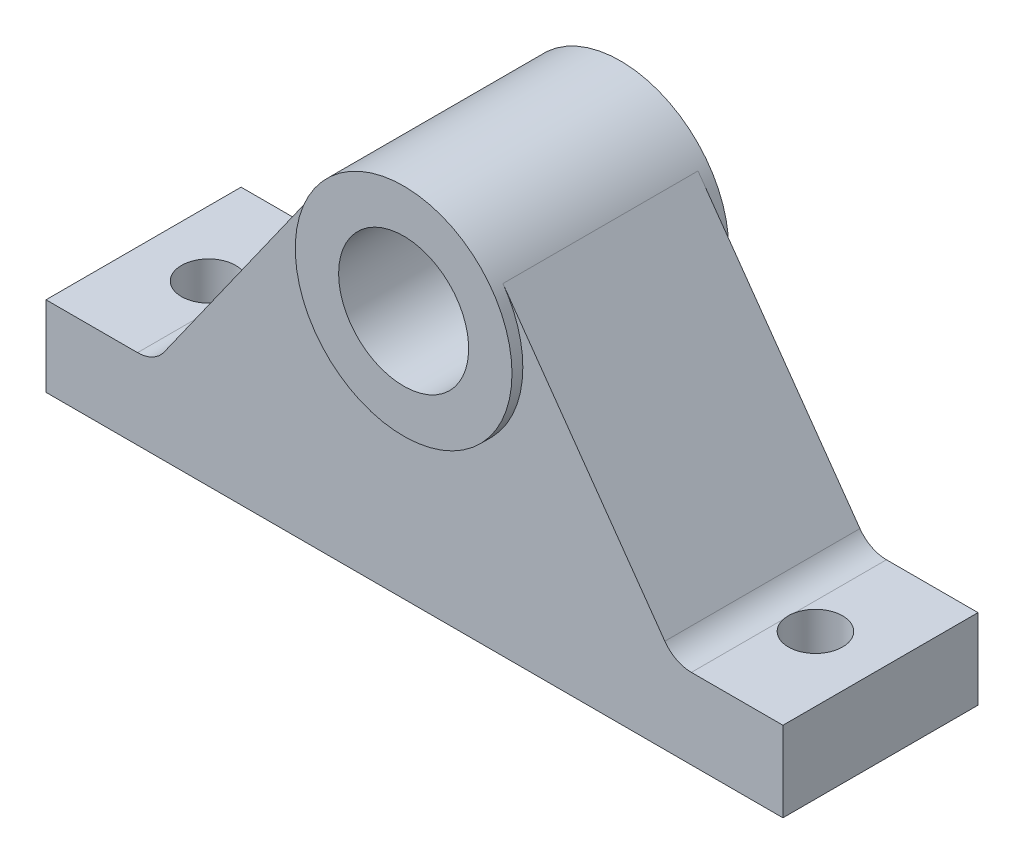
ISO-10303-21;
HEADER;
FILE_DESCRIPTION(('STEP AP214'),'2;1');
FILE_NAME('part.step','',(''),(''),'','','');
FILE_SCHEMA(('AUTOMOTIVE_DESIGN { 1 0 10303 214 1 1 1 1 }'));
ENDSEC;
DATA;
#1=APPLICATION_CONTEXT('core data for automotive mechanical design processes');
#2=APPLICATION_PROTOCOL_DEFINITION('international standard','automotive_design',2000,#1);
#3=PRODUCT_CONTEXT('',#1,'mechanical');
#4=PRODUCT('Part','Part','',(#3));
#5=PRODUCT_RELATED_PRODUCT_CATEGORY('part','',(#4));
#6=PRODUCT_DEFINITION_FORMATION('','',#4);
#7=PRODUCT_DEFINITION_CONTEXT('part definition',#1,'design');
#8=PRODUCT_DEFINITION('design','',#6,#7);
#9=PRODUCT_DEFINITION_SHAPE('','',#8);
#10=(LENGTH_UNIT() NAMED_UNIT(*) SI_UNIT(.MILLI.,.METRE.));
#11=(NAMED_UNIT(*) PLANE_ANGLE_UNIT() SI_UNIT($,.RADIAN.));
#12=(NAMED_UNIT(*) SI_UNIT($,.STERADIAN.) SOLID_ANGLE_UNIT());
#13=UNCERTAINTY_MEASURE_WITH_UNIT(LENGTH_MEASURE(1.E-05),#10,'distance_accuracy_value','');
#14=(GEOMETRIC_REPRESENTATION_CONTEXT(3) GLOBAL_UNCERTAINTY_ASSIGNED_CONTEXT((#13)) GLOBAL_UNIT_ASSIGNED_CONTEXT((#10,
#11,#12)) REPRESENTATION_CONTEXT('',''));
#15=CARTESIAN_POINT('',(0.,0.,0.));
#16=DIRECTION('',(0.,0.,1.));
#17=DIRECTION('',(1.,0.,0.));
#18=AXIS2_PLACEMENT_3D('',#15,#16,#17);
#19=CARTESIAN_POINT('',(0.,83.,45.));
#20=DIRECTION('',(0.,0.,1.));
#21=DIRECTION('',(1.,0.,0.));
#22=AXIS2_PLACEMENT_3D('',#19,#20,#21);
#23=PLANE('',#22);
#24=CARTESIAN_POINT('',(0.,83.,45.));
#25=DIRECTION('',(0.,0.,1.));
#26=DIRECTION('',(1.,0.,0.));
#27=AXIS2_PLACEMENT_3D('',#24,#25,#26);
#28=CIRCLE('',#27,50.);
#29=CARTESIAN_POINT('',(-40.8122898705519,111.885238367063,45.));
#30=VERTEX_POINT('',#29);
#31=CARTESIAN_POINT('',(40.8122898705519,111.885238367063,45.));
#32=VERTEX_POINT('',#31);
#33=EDGE_CURVE('E279',#30,#32,#28,.T.);
#34=ORIENTED_EDGE('',*,*,#33,.F.);
#35=DIRECTION('',(-0.57770476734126,-0.816245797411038,0.));
#36=VECTOR('',#35,1.);
#37=CARTESIAN_POINT('',(-40.8122898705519,111.885238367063,45.));
#38=LINE('',#37,#36);
#39=CARTESIAN_POINT('',(-115.516755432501,6.3344284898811,45.));
#40=VERTEX_POINT('',#39);
#41=EDGE_CURVE('E272',#30,#40,#38,.T.);
#42=ORIENTED_EDGE('',*,*,#41,.T.);
#43=CARTESIAN_POINT('',(-127.760442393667,15.,45.));
#44=DIRECTION('',(0.,0.,1.));
#45=DIRECTION('',(1.,0.,0.));
#46=AXIS2_PLACEMENT_3D('',#43,#44,#45);
#47=CIRCLE('',#46,15.);
#48=CARTESIAN_POINT('',(-127.760442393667,0.,45.));
#49=VERTEX_POINT('',#48);
#50=EDGE_CURVE('E166',#40,#49,#47,.F.);
#51=ORIENTED_EDGE('',*,*,#50,.T.);
#52=DIRECTION('',(-1.,0.,0.));
#53=VECTOR('',#52,1.);
#54=CARTESIAN_POINT('',(-170.,0.,45.));
#55=LINE('',#54,#53);
#56=CARTESIAN_POINT('',(-170.,0.,45.));
#57=VERTEX_POINT('',#56);
#58=EDGE_CURVE('E269',#49,#57,#55,.T.);
#59=ORIENTED_EDGE('',*,*,#58,.T.);
#60=DIRECTION('',(0.,-1.,0.));
#61=VECTOR('',#60,1.);
#62=CARTESIAN_POINT('',(-170.,0.,45.));
#63=LINE('',#62,#61);
#64=CARTESIAN_POINT('',(-170.,-37.,45.));
#65=VERTEX_POINT('',#64);
#66=EDGE_CURVE('E259',#57,#65,#63,.T.);
#67=ORIENTED_EDGE('',*,*,#66,.T.);
#68=DIRECTION('',(1.,0.,0.));
#69=VECTOR('',#68,1.);
#70=CARTESIAN_POINT('',(-170.,-37.,45.));
#71=LINE('',#70,#69);
#72=CARTESIAN_POINT('',(170.,-37.,45.));
#73=VERTEX_POINT('',#72);
#74=EDGE_CURVE('E263',#65,#73,#71,.T.);
#75=ORIENTED_EDGE('',*,*,#74,.T.);
#76=DIRECTION('',(0.,1.,0.));
#77=VECTOR('',#76,1.);
#78=CARTESIAN_POINT('',(170.,0.,45.));
#79=LINE('',#78,#77);
#80=CARTESIAN_POINT('',(170.,0.,45.));
#81=VERTEX_POINT('',#80);
#82=EDGE_CURVE('E246',#73,#81,#79,.T.);
#83=ORIENTED_EDGE('',*,*,#82,.T.);
#84=DIRECTION('',(-1.,0.,0.));
#85=VECTOR('',#84,1.);
#86=CARTESIAN_POINT('',(120.,0.,45.));
#87=LINE('',#86,#85);
#88=CARTESIAN_POINT('',(127.760442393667,0.,45.));
#89=VERTEX_POINT('',#88);
#90=EDGE_CURVE('E266',#81,#89,#87,.T.);
#91=ORIENTED_EDGE('',*,*,#90,.T.);
#92=CARTESIAN_POINT('',(127.760442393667,15.,45.));
#93=DIRECTION('',(0.,0.,1.));
#94=DIRECTION('',(1.,0.,0.));
#95=AXIS2_PLACEMENT_3D('',#92,#93,#94);
#96=CIRCLE('',#95,15.);
#97=CARTESIAN_POINT('',(115.516755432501,6.3344284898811,45.));
#98=VERTEX_POINT('',#97);
#99=EDGE_CURVE('E147',#89,#98,#96,.F.);
#100=ORIENTED_EDGE('',*,*,#99,.T.);
#101=DIRECTION('',(-0.57770476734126,0.816245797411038,0.));
#102=VECTOR('',#101,1.);
#103=CARTESIAN_POINT('',(40.8122898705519,111.885238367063,45.));
#104=LINE('',#103,#102);
#105=EDGE_CURVE('E268',#98,#32,#104,.T.);
#106=ORIENTED_EDGE('',*,*,#105,.T.);
#107=EDGE_LOOP('',(#34,#42,#51,#59,#67,#75,#83,#91,#100,#106));
#108=FACE_BOUND('',#107,.T.);
#109=ADVANCED_FACE('F39',(#108),#23,.T.);
#110=CARTESIAN_POINT('',(0.,83.,-45.));
#111=DIRECTION('',(0.,0.,1.));
#112=DIRECTION('',(1.,0.,0.));
#113=AXIS2_PLACEMENT_3D('',#110,#111,#112);
#114=PLANE('',#113);
#115=DIRECTION('',(-0.57770476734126,-0.816245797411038,0.));
#116=VECTOR('',#115,1.);
#117=CARTESIAN_POINT('',(-40.8122898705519,111.885238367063,-45.));
#118=LINE('',#117,#116);
#119=CARTESIAN_POINT('',(-40.8122898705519,111.885238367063,-45.));
#120=VERTEX_POINT('',#119);
#121=CARTESIAN_POINT('',(-115.516755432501,6.3344284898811,-45.));
#122=VERTEX_POINT('',#121);
#123=EDGE_CURVE('E260',#120,#122,#118,.T.);
#124=ORIENTED_EDGE('',*,*,#123,.F.);
#125=CARTESIAN_POINT('',(0.,83.,-45.));
#126=DIRECTION('',(0.,0.,1.));
#127=DIRECTION('',(1.,0.,0.));
#128=AXIS2_PLACEMENT_3D('',#125,#126,#127);
#129=CIRCLE('',#128,50.);
#130=CARTESIAN_POINT('',(40.8122898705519,111.885238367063,-45.));
#131=VERTEX_POINT('',#130);
#132=EDGE_CURVE('E152',#120,#131,#129,.T.);
#133=ORIENTED_EDGE('',*,*,#132,.T.);
#134=DIRECTION('',(-0.57770476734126,0.816245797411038,0.));
#135=VECTOR('',#134,1.);
#136=CARTESIAN_POINT('',(40.8122898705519,111.885238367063,-45.));
#137=LINE('',#136,#135);
#138=CARTESIAN_POINT('',(115.516755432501,6.3344284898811,-45.));
#139=VERTEX_POINT('',#138);
#140=EDGE_CURVE('E253',#139,#131,#137,.T.);
#141=ORIENTED_EDGE('',*,*,#140,.F.);
#142=CARTESIAN_POINT('',(127.760442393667,15.,-45.));
#143=DIRECTION('',(0.,0.,1.));
#144=DIRECTION('',(1.,0.,0.));
#145=AXIS2_PLACEMENT_3D('',#142,#143,#144);
#146=CIRCLE('',#145,15.);
#147=CARTESIAN_POINT('',(127.760442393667,0.,-45.));
#148=VERTEX_POINT('',#147);
#149=EDGE_CURVE('E161',#139,#148,#146,.T.);
#150=ORIENTED_EDGE('',*,*,#149,.T.);
#151=DIRECTION('',(-1.,0.,0.));
#152=VECTOR('',#151,1.);
#153=CARTESIAN_POINT('',(120.,0.,-45.));
#154=LINE('',#153,#152);
#155=CARTESIAN_POINT('',(170.,0.,-45.));
#156=VERTEX_POINT('',#155);
#157=EDGE_CURVE('E251',#156,#148,#154,.T.);
#158=ORIENTED_EDGE('',*,*,#157,.F.);
#159=DIRECTION('',(0.,1.,0.));
#160=VECTOR('',#159,1.);
#161=CARTESIAN_POINT('',(170.,0.,-45.));
#162=LINE('',#161,#160);
#163=CARTESIAN_POINT('',(170.,-37.,-45.));
#164=VERTEX_POINT('',#163);
#165=EDGE_CURVE('E241',#164,#156,#162,.T.);
#166=ORIENTED_EDGE('',*,*,#165,.F.);
#167=DIRECTION('',(1.,0.,0.));
#168=VECTOR('',#167,1.);
#169=CARTESIAN_POINT('',(-170.,-37.,-45.));
#170=LINE('',#169,#168);
#171=CARTESIAN_POINT('',(-170.,-37.,-45.));
#172=VERTEX_POINT('',#171);
#173=EDGE_CURVE('E232',#172,#164,#170,.T.);
#174=ORIENTED_EDGE('',*,*,#173,.F.);
#175=DIRECTION('',(0.,-1.,0.));
#176=VECTOR('',#175,1.);
#177=CARTESIAN_POINT('',(-170.,0.,-45.));
#178=LINE('',#177,#176);
#179=CARTESIAN_POINT('',(-170.,0.,-45.));
#180=VERTEX_POINT('',#179);
#181=EDGE_CURVE('E242',#180,#172,#178,.T.);
#182=ORIENTED_EDGE('',*,*,#181,.F.);
#183=DIRECTION('',(-1.,0.,0.));
#184=VECTOR('',#183,1.);
#185=CARTESIAN_POINT('',(-170.,0.,-45.));
#186=LINE('',#185,#184);
#187=CARTESIAN_POINT('',(-127.760442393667,0.,-45.));
#188=VERTEX_POINT('',#187);
#189=EDGE_CURVE('E257',#188,#180,#186,.T.);
#190=ORIENTED_EDGE('',*,*,#189,.F.);
#191=CARTESIAN_POINT('',(-127.760442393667,15.,-45.));
#192=DIRECTION('',(0.,0.,1.));
#193=DIRECTION('',(1.,0.,0.));
#194=AXIS2_PLACEMENT_3D('',#191,#192,#193);
#195=CIRCLE('',#194,15.);
#196=EDGE_CURVE('E164',#188,#122,#195,.T.);
#197=ORIENTED_EDGE('',*,*,#196,.T.);
#198=EDGE_LOOP('',(#124,#133,#141,#150,#158,#166,#174,#182,#190,#197));
#199=FACE_BOUND('',#198,.T.);
#200=ADVANCED_FACE('F185',(#199),#114,.F.);
#201=CARTESIAN_POINT('',(-170.,0.,45.));
#202=DIRECTION('',(1.,0.,0.));
#203=DIRECTION('',(0.,0.,-1.));
#204=AXIS2_PLACEMENT_3D('',#201,#202,#203);
#205=PLANE('',#204);
#206=ORIENTED_EDGE('',*,*,#181,.T.);
#207=DIRECTION('',(0.,0.,-1.));
#208=VECTOR('',#207,1.);
#209=CARTESIAN_POINT('',(-170.,-37.,45.));
#210=LINE('',#209,#208);
#211=EDGE_CURVE('E237',#65,#172,#210,.T.);
#212=ORIENTED_EDGE('',*,*,#211,.F.);
#213=ORIENTED_EDGE('',*,*,#66,.F.);
#214=DIRECTION('',(0.,0.,-1.));
#215=VECTOR('',#214,1.);
#216=CARTESIAN_POINT('',(-170.,0.,45.));
#217=LINE('',#216,#215);
#218=EDGE_CURVE('E271',#57,#180,#217,.T.);
#219=ORIENTED_EDGE('',*,*,#218,.T.);
#220=EDGE_LOOP('',(#206,#212,#213,#219));
#221=FACE_BOUND('',#220,.T.);
#222=ADVANCED_FACE('F41',(#221),#205,.F.);
#223=CARTESIAN_POINT('',(-170.,-37.,45.));
#224=DIRECTION('',(0.,1.,0.));
#225=DIRECTION('',(-1.,0.,0.));
#226=AXIS2_PLACEMENT_3D('',#223,#224,#225);
#227=PLANE('',#226);
#228=CARTESIAN_POINT('',(140.,-37.,0.));
#229=DIRECTION('',(0.,-1.,0.));
#230=DIRECTION('',(1.,0.,0.));
#231=AXIS2_PLACEMENT_3D('',#228,#229,#230);
#232=CIRCLE('',#231,12.5);
#233=CARTESIAN_POINT('',(152.5,-37.,0.));
#234=VERTEX_POINT('',#233);
#235=EDGE_CURVE('E142',#234,#234,#232,.T.);
#236=ORIENTED_EDGE('',*,*,#235,.F.);
#237=EDGE_LOOP('',(#236));
#238=FACE_BOUND('',#237,.T.);
#239=CARTESIAN_POINT('',(-140.,-37.,0.));
#240=DIRECTION('',(0.,-1.,0.));
#241=DIRECTION('',(1.,0.,0.));
#242=AXIS2_PLACEMENT_3D('',#239,#240,#241);
#243=CIRCLE('',#242,12.5);
#244=CARTESIAN_POINT('',(-127.5,-37.,0.));
#245=VERTEX_POINT('',#244);
#246=EDGE_CURVE('E141',#245,#245,#243,.T.);
#247=ORIENTED_EDGE('',*,*,#246,.F.);
#248=EDGE_LOOP('',(#247));
#249=FACE_BOUND('',#248,.T.);
#250=ORIENTED_EDGE('',*,*,#173,.T.);
#251=DIRECTION('',(0.,0.,-1.));
#252=VECTOR('',#251,1.);
#253=CARTESIAN_POINT('',(170.,-37.,45.));
#254=LINE('',#253,#252);
#255=EDGE_CURVE('E234',#73,#164,#254,.T.);
#256=ORIENTED_EDGE('',*,*,#255,.F.);
#257=ORIENTED_EDGE('',*,*,#74,.F.);
#258=ORIENTED_EDGE('',*,*,#211,.T.);
#259=EDGE_LOOP('',(#250,#256,#257,#258));
#260=FACE_BOUND('',#259,.T.);
#261=ADVANCED_FACE('F217',(#238,#249,#260),#227,.F.);
#262=CARTESIAN_POINT('',(170.,0.,45.));
#263=DIRECTION('',(-1.,0.,0.));
#264=DIRECTION('',(0.,-1.,0.));
#265=AXIS2_PLACEMENT_3D('',#262,#263,#264);
#266=PLANE('',#265);
#267=ORIENTED_EDGE('',*,*,#165,.T.);
#268=DIRECTION('',(0.,0.,-1.));
#269=VECTOR('',#268,1.);
#270=CARTESIAN_POINT('',(170.,0.,45.));
#271=LINE('',#270,#269);
#272=EDGE_CURVE('E247',#81,#156,#271,.T.);
#273=ORIENTED_EDGE('',*,*,#272,.F.);
#274=ORIENTED_EDGE('',*,*,#82,.F.);
#275=ORIENTED_EDGE('',*,*,#255,.T.);
#276=EDGE_LOOP('',(#267,#273,#274,#275));
#277=FACE_BOUND('',#276,.T.);
#278=ADVANCED_FACE('F215',(#277),#266,.F.);
#279=CARTESIAN_POINT('',(120.,0.,45.));
#280=DIRECTION('',(0.,-1.,0.));
#281=DIRECTION('',(0.,0.,-1.));
#282=AXIS2_PLACEMENT_3D('',#279,#280,#281);
#283=PLANE('',#282);
#284=DIRECTION('',(0.,0.,-1.));
#285=VECTOR('',#284,1.);
#286=CARTESIAN_POINT('',(127.760442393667,0.,45.));
#287=LINE('',#286,#285);
#288=CARTESIAN_POINT('',(127.760442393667,0.,-2.53835174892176));
#289=VERTEX_POINT('',#288);
#290=EDGE_CURVE('E140',#148,#289,#287,.F.);
#291=ORIENTED_EDGE('',*,*,#290,.T.);
#292=CARTESIAN_POINT('',(140.,0.,0.));
#293=DIRECTION('',(0.,-1.,0.));
#294=DIRECTION('',(0.,0.,-1.));
#295=AXIS2_PLACEMENT_3D('',#292,#293,#294);
#296=CIRCLE('',#295,12.5);
#297=CARTESIAN_POINT('',(127.760442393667,0.,2.53835174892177));
#298=VERTEX_POINT('',#297);
#299=EDGE_CURVE('E58',#289,#298,#296,.T.);
#300=ORIENTED_EDGE('',*,*,#299,.T.);
#301=EDGE_CURVE('E137',#298,#89,#287,.F.);
#302=ORIENTED_EDGE('',*,*,#301,.T.);
#303=ORIENTED_EDGE('',*,*,#90,.F.);
#304=ORIENTED_EDGE('',*,*,#272,.T.);
#305=ORIENTED_EDGE('',*,*,#157,.T.);
#306=EDGE_LOOP('',(#291,#300,#302,#303,#304,#305));
#307=FACE_BOUND('',#306,.T.);
#308=ADVANCED_FACE('F135',(#307),#283,.F.);
#309=CARTESIAN_POINT('',(40.8122898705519,111.885238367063,45.));
#310=DIRECTION('',(-0.816245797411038,-0.577704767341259,0.));
#311=DIRECTION('',(0.57770476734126,-0.816245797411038,0.));
#312=AXIS2_PLACEMENT_3D('',#309,#310,#311);
#313=PLANE('',#312);
#314=ORIENTED_EDGE('',*,*,#105,.F.);
#315=DIRECTION('',(0.,0.,-1.));
#316=VECTOR('',#315,1.);
#317=CARTESIAN_POINT('',(115.516755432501,6.33442848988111,-45.));
#318=LINE('',#317,#316);
#319=EDGE_CURVE('E148',#98,#139,#318,.T.);
#320=ORIENTED_EDGE('',*,*,#319,.T.);
#321=ORIENTED_EDGE('',*,*,#140,.T.);
#322=DIRECTION('',(0.,0.,-1.));
#323=VECTOR('',#322,1.);
#324=CARTESIAN_POINT('',(40.8122898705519,111.885238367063,45.));
#325=LINE('',#324,#323);
#326=EDGE_CURVE('E276',#32,#131,#325,.T.);
#327=ORIENTED_EDGE('',*,*,#326,.F.);
#328=EDGE_LOOP('',(#314,#320,#321,#327));
#329=FACE_BOUND('',#328,.T.);
#330=ADVANCED_FACE('F208',(#329),#313,.F.);
#331=CARTESIAN_POINT('',(0.,83.,45.));
#332=DIRECTION('',(0.,0.,-1.));
#333=DIRECTION('',(-1.,0.,0.));
#334=AXIS2_PLACEMENT_3D('',#331,#332,#333);
#335=CYLINDRICAL_SURFACE('',#334,50.);
#336=ORIENTED_EDGE('',*,*,#326,.T.);
#337=ORIENTED_EDGE('',*,*,#132,.F.);
#338=DIRECTION('',(0.,0.,-1.));
#339=VECTOR('',#338,1.);
#340=CARTESIAN_POINT('',(-40.8122898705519,111.885238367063,45.));
#341=LINE('',#340,#339);
#342=EDGE_CURVE('E275',#30,#120,#341,.T.);
#343=ORIENTED_EDGE('',*,*,#342,.F.);
#344=ORIENTED_EDGE('',*,*,#33,.T.);
#345=EDGE_LOOP('',(#336,#337,#343,#344));
#346=FACE_BOUND('',#345,.T.);
#347=CARTESIAN_POINT('',(0.,83.,50.));
#348=DIRECTION('',(0.,0.,1.));
#349=DIRECTION('',(1.,0.,0.));
#350=AXIS2_PLACEMENT_3D('',#347,#348,#349);
#351=CIRCLE('',#350,50.);
#352=CARTESIAN_POINT('',(50.,83.,50.));
#353=VERTEX_POINT('',#352);
#354=EDGE_CURVE('E323',#353,#353,#351,.T.);
#355=ORIENTED_EDGE('',*,*,#354,.F.);
#356=EDGE_LOOP('',(#355));
#357=FACE_BOUND('',#356,.T.);
#358=CARTESIAN_POINT('',(0.,83.,-50.));
#359=DIRECTION('',(0.,0.,1.));
#360=DIRECTION('',(1.,0.,0.));
#361=AXIS2_PLACEMENT_3D('',#358,#359,#360);
#362=CIRCLE('',#361,50.);
#363=CARTESIAN_POINT('',(50.,83.,-50.));
#364=VERTEX_POINT('',#363);
#365=EDGE_CURVE('E330',#364,#364,#362,.T.);
#366=ORIENTED_EDGE('',*,*,#365,.T.);
#367=EDGE_LOOP('',(#366));
#368=FACE_BOUND('',#367,.T.);
#369=ADVANCED_FACE('F204',(#346,#357,#368),#335,.T.);
#370=CARTESIAN_POINT('',(-40.8122898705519,111.885238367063,45.));
#371=DIRECTION('',(0.816245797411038,-0.57770476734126,0.));
#372=DIRECTION('',(0.57770476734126,0.816245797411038,0.));
#373=AXIS2_PLACEMENT_3D('',#370,#371,#372);
#374=PLANE('',#373);
#375=ORIENTED_EDGE('',*,*,#123,.T.);
#376=DIRECTION('',(0.,0.,-1.));
#377=VECTOR('',#376,1.);
#378=CARTESIAN_POINT('',(-115.516755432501,6.33442848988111,45.));
#379=LINE('',#378,#377);
#380=EDGE_CURVE('E159',#122,#40,#379,.F.);
#381=ORIENTED_EDGE('',*,*,#380,.T.);
#382=ORIENTED_EDGE('',*,*,#41,.F.);
#383=ORIENTED_EDGE('',*,*,#342,.T.);
#384=EDGE_LOOP('',(#375,#381,#382,#383));
#385=FACE_BOUND('',#384,.T.);
#386=ADVANCED_FACE('F200',(#385),#374,.F.);
#387=CARTESIAN_POINT('',(-170.,0.,45.));
#388=DIRECTION('',(0.,-1.,0.));
#389=DIRECTION('',(0.,0.,-1.));
#390=AXIS2_PLACEMENT_3D('',#387,#388,#389);
#391=PLANE('',#390);
#392=DIRECTION('',(0.,0.,-1.));
#393=VECTOR('',#392,1.);
#394=CARTESIAN_POINT('',(-127.760442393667,0.,-45.));
#395=LINE('',#394,#393);
#396=CARTESIAN_POINT('',(-127.760442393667,0.,2.5383517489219));
#397=VERTEX_POINT('',#396);
#398=EDGE_CURVE('E156',#49,#397,#395,.T.);
#399=ORIENTED_EDGE('',*,*,#398,.T.);
#400=CARTESIAN_POINT('',(-140.,0.,0.));
#401=DIRECTION('',(0.,-1.,0.));
#402=DIRECTION('',(0.,0.,-1.));
#403=AXIS2_PLACEMENT_3D('',#400,#401,#402);
#404=CIRCLE('',#403,12.5);
#405=CARTESIAN_POINT('',(-127.760442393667,0.,-2.5383517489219));
#406=VERTEX_POINT('',#405);
#407=EDGE_CURVE('E64',#397,#406,#404,.T.);
#408=ORIENTED_EDGE('',*,*,#407,.T.);
#409=EDGE_CURVE('E150',#406,#188,#395,.T.);
#410=ORIENTED_EDGE('',*,*,#409,.T.);
#411=ORIENTED_EDGE('',*,*,#189,.T.);
#412=ORIENTED_EDGE('',*,*,#218,.F.);
#413=ORIENTED_EDGE('',*,*,#58,.F.);
#414=EDGE_LOOP('',(#399,#408,#410,#411,#412,#413));
#415=FACE_BOUND('',#414,.T.);
#416=ADVANCED_FACE('F196',(#415),#391,.F.);
#417=CARTESIAN_POINT('',(0.,83.,45.));
#418=DIRECTION('',(0.,0.,-1.));
#419=DIRECTION('',(-1.,0.,0.));
#420=AXIS2_PLACEMENT_3D('',#417,#418,#419);
#421=CYLINDRICAL_SURFACE('',#420,30.);
#422=CARTESIAN_POINT('',(0.,83.,50.));
#423=DIRECTION('',(0.,0.,1.));
#424=DIRECTION('',(1.,0.,0.));
#425=AXIS2_PLACEMENT_3D('',#422,#423,#424);
#426=CIRCLE('',#425,30.);
#427=CARTESIAN_POINT('',(-30.,83.,50.));
#428=VERTEX_POINT('',#427);
#429=EDGE_CURVE('E325',#428,#428,#426,.T.);
#430=CARTESIAN_POINT('',(0.,83.,-50.));
#431=DIRECTION('',(0.,0.,1.));
#432=DIRECTION('',(1.,0.,0.));
#433=AXIS2_PLACEMENT_3D('',#430,#431,#432);
#434=CIRCLE('',#433,30.);
#435=CARTESIAN_POINT('',(-30.,83.,-50.));
#436=VERTEX_POINT('',#435);
#437=EDGE_CURVE('E333',#436,#436,#434,.T.);
#438=CARTESIAN_POINT('',(-30.,83.,50.));
#439=CARTESIAN_POINT('',(-30.,83.,48.9583333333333));
#440=CARTESIAN_POINT('',(-30.,83.,47.9166666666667));
#441=CARTESIAN_POINT('',(-30.,83.,45.8333333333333));
#442=CARTESIAN_POINT('',(-30.,83.,44.7916666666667));
#443=CARTESIAN_POINT('',(-30.,83.,42.7083333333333));
#444=CARTESIAN_POINT('',(-30.,83.,41.6666666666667));
#445=CARTESIAN_POINT('',(-30.,83.,39.5833333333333));
#446=CARTESIAN_POINT('',(-30.,83.,38.5416666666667));
#447=CARTESIAN_POINT('',(-30.,83.,36.4583333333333));
#448=CARTESIAN_POINT('',(-30.,83.,35.4166666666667));
#449=CARTESIAN_POINT('',(-30.,83.,33.3333333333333));
#450=CARTESIAN_POINT('',(-30.,83.,32.2916666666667));
#451=CARTESIAN_POINT('',(-30.,83.,30.2083333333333));
#452=CARTESIAN_POINT('',(-30.,83.,29.1666666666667));
#453=CARTESIAN_POINT('',(-30.,83.,27.0833333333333));
#454=CARTESIAN_POINT('',(-30.,83.,26.0416666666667));
#455=CARTESIAN_POINT('',(-30.,83.,23.9583333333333));
#456=CARTESIAN_POINT('',(-30.,83.,22.9166666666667));
#457=CARTESIAN_POINT('',(-30.,83.,20.8333333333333));
#458=CARTESIAN_POINT('',(-30.,83.,19.7916666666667));
#459=CARTESIAN_POINT('',(-30.,83.,17.7083333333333));
#460=CARTESIAN_POINT('',(-30.,83.,16.6666666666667));
#461=CARTESIAN_POINT('',(-30.,83.,14.5833333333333));
#462=CARTESIAN_POINT('',(-30.,83.,13.5416666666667));
#463=CARTESIAN_POINT('',(-30.,83.,11.4583333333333));
#464=CARTESIAN_POINT('',(-30.,83.,10.4166666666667));
#465=CARTESIAN_POINT('',(-30.,83.,8.33333333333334));
#466=CARTESIAN_POINT('',(-30.,83.,7.29166666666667));
#467=CARTESIAN_POINT('',(-30.,83.,5.20833333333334));
#468=CARTESIAN_POINT('',(-30.,83.,4.16666666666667));
#469=CARTESIAN_POINT('',(-30.,83.,2.08333333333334));
#470=CARTESIAN_POINT('',(-30.,83.,1.04166666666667));
#471=CARTESIAN_POINT('',(-30.,83.,-1.04166666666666));
#472=CARTESIAN_POINT('',(-30.,83.,-2.08333333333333));
#473=CARTESIAN_POINT('',(-30.,83.,-4.16666666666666));
#474=CARTESIAN_POINT('',(-30.,83.,-5.20833333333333));
#475=CARTESIAN_POINT('',(-30.,83.,-7.29166666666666));
#476=CARTESIAN_POINT('',(-30.,83.,-8.33333333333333));
#477=CARTESIAN_POINT('',(-30.,83.,-10.4166666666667));
#478=CARTESIAN_POINT('',(-30.,83.,-11.4583333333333));
#479=CARTESIAN_POINT('',(-30.,83.,-13.5416666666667));
#480=CARTESIAN_POINT('',(-30.,83.,-14.5833333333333));
#481=CARTESIAN_POINT('',(-30.,83.,-16.6666666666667));
#482=CARTESIAN_POINT('',(-30.,83.,-17.7083333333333));
#483=CARTESIAN_POINT('',(-30.,83.,-19.7916666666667));
#484=CARTESIAN_POINT('',(-30.,83.,-20.8333333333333));
#485=CARTESIAN_POINT('',(-30.,83.,-22.9166666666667));
#486=CARTESIAN_POINT('',(-30.,83.,-23.9583333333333));
#487=CARTESIAN_POINT('',(-30.,83.,-26.0416666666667));
#488=CARTESIAN_POINT('',(-30.,83.,-27.0833333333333));
#489=CARTESIAN_POINT('',(-30.,83.,-29.1666666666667));
#490=CARTESIAN_POINT('',(-30.,83.,-30.2083333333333));
#491=CARTESIAN_POINT('',(-30.,83.,-32.2916666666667));
#492=CARTESIAN_POINT('',(-30.,83.,-33.3333333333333));
#493=CARTESIAN_POINT('',(-30.,83.,-35.4166666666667));
#494=CARTESIAN_POINT('',(-30.,83.,-36.4583333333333));
#495=CARTESIAN_POINT('',(-30.,83.,-38.5416666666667));
#496=CARTESIAN_POINT('',(-30.,83.,-39.5833333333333));
#497=CARTESIAN_POINT('',(-30.,83.,-41.6666666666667));
#498=CARTESIAN_POINT('',(-30.,83.,-42.7083333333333));
#499=CARTESIAN_POINT('',(-30.,83.,-44.7916666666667));
#500=CARTESIAN_POINT('',(-30.,83.,-45.8333333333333));
#501=CARTESIAN_POINT('',(-30.,83.,-47.9166666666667));
#502=CARTESIAN_POINT('',(-30.,83.,-48.9583333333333));
#503=CARTESIAN_POINT('',(-30.,83.,-50.));
#504=B_SPLINE_CURVE_WITH_KNOTS('',3,(#438,#439,#440,#441,#442,#443,#444,#445,#446,#447,#448,
#449,#450,#451,#452,#453,#454,#455,#456,#457,#458,#459,#460,#461,#462,#463,#464,#465,#466,#467,
#468,#469,#470,#471,#472,#473,#474,#475,#476,#477,#478,#479,#480,#481,#482,#483,#484,#485,#486,
#487,#488,#489,#490,#491,#492,#493,#494,#495,#496,#497,#498,#499,#500,#501,#502,#503),
.UNSPECIFIED.,.F.,.F.,(4,2,2,2,2,2,2,2,2,2,2,2,2,2,2,2,2,2,2,2,2,2,2,2,2,2,2,2,2,2,2,2,4),(0.,
3.125,6.25,9.375,12.5,15.625,18.75,21.875,25.,28.125,31.25,34.375,37.5,40.625,43.75,46.875,50.,
53.125,56.25,59.375,62.5,65.625,68.75,71.875,75.,78.125,81.25,84.375,87.5,90.625,93.75,96.875,
100.),.UNSPECIFIED.);
#505=EDGE_CURVE('BSEAM199',#428,#436,#504,.T.);
#506=ORIENTED_EDGE('',*,*,#429,.T.);
#507=ORIENTED_EDGE('',*,*,#437,.F.);
#508=ORIENTED_EDGE('',*,*,#505,.T.);
#509=ORIENTED_EDGE('',*,*,#505,.F.);
#510=EDGE_LOOP('',(#506,#508,#507,#509));
#511=FACE_BOUND('',#510,.T.);
#512=ADVANCED_FACE('F199',(#511),#421,.F.);
#513=CARTESIAN_POINT('',(0.,83.,50.));
#514=DIRECTION('',(0.,0.,1.));
#515=DIRECTION('',(1.,0.,0.));
#516=AXIS2_PLACEMENT_3D('',#513,#514,#515);
#517=PLANE('',#516);
#518=ORIENTED_EDGE('',*,*,#354,.T.);
#519=EDGE_LOOP('',(#518));
#520=FACE_BOUND('',#519,.T.);
#521=ORIENTED_EDGE('',*,*,#429,.F.);
#522=EDGE_LOOP('',(#521));
#523=FACE_BOUND('',#522,.T.);
#524=ADVANCED_FACE('F344',(#520,#523),#517,.T.);
#525=CARTESIAN_POINT('',(0.,83.,-50.));
#526=DIRECTION('',(0.,0.,-1.));
#527=DIRECTION('',(1.,0.,0.));
#528=AXIS2_PLACEMENT_3D('',#525,#526,#527);
#529=PLANE('',#528);
#530=ORIENTED_EDGE('',*,*,#437,.T.);
#531=EDGE_LOOP('',(#530));
#532=FACE_BOUND('',#531,.T.);
#533=ORIENTED_EDGE('',*,*,#365,.F.);
#534=EDGE_LOOP('',(#533));
#535=FACE_BOUND('',#534,.T.);
#536=ADVANCED_FACE('F340',(#532,#535),#529,.T.);
#537=CARTESIAN_POINT('',(127.760442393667,15.,45.));
#538=DIRECTION('',(0.,0.,1.));
#539=DIRECTION('',(1.,0.,0.));
#540=AXIS2_PLACEMENT_3D('',#537,#538,#539);
#541=CYLINDRICAL_SURFACE('',#540,15.);
#542=ORIENTED_EDGE('',*,*,#301,.F.);
#543=CARTESIAN_POINT('',(142.760442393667,15.,-12.191388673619));
#544=CARTESIAN_POINT('',(142.760440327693,15.4187854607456,-12.1913927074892));
#545=CARTESIAN_POINT('',(142.74288917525,15.8376131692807,-12.1954040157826));
#546=CARTESIAN_POINT('',(142.672822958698,16.6722270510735,-12.2109488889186));
#547=CARTESIAN_POINT('',(142.620302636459,17.0880127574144,-12.2224835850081));
#548=CARTESIAN_POINT('',(142.480640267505,17.9140030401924,-12.2515921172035));
#549=CARTESIAN_POINT('',(142.393458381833,18.3242006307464,-12.2691728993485));
#550=CARTESIAN_POINT('',(142.185131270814,19.1356779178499,-12.3079814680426));
#551=CARTESIAN_POINT('',(142.06398708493,19.5369578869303,-12.3292091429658));
#552=CARTESIAN_POINT('',(141.788615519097,20.3278160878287,-12.3721562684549));
#553=CARTESIAN_POINT('',(141.634399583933,20.7173983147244,-12.3938755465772));
#554=CARTESIAN_POINT('',(141.29383769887,21.4824799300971,-12.4340407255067));
#555=CARTESIAN_POINT('',(141.107489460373,21.8579783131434,-12.4524863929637));
#556=CARTESIAN_POINT('',(140.704030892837,22.5920210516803,-12.4817951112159));
#557=CARTESIAN_POINT('',(140.486944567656,22.9505783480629,-12.4926640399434));
#558=CARTESIAN_POINT('',(140.023443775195,23.6483587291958,-12.5021254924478));
#559=CARTESIAN_POINT('',(139.777035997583,23.9875861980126,-12.500720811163));
#560=CARTESIAN_POINT('',(139.307966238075,24.5795643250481,-12.4825814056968));
#561=CARTESIAN_POINT('',(139.090116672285,24.8362322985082,-12.4689054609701));
#562=CARTESIAN_POINT('',(138.638265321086,25.3337222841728,-12.4276756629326));
#563=CARTESIAN_POINT('',(138.404266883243,25.5745475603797,-12.4001246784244));
#564=CARTESIAN_POINT('',(137.922130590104,26.0386577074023,-12.3284952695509));
#565=CARTESIAN_POINT('',(137.674003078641,26.2619551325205,-12.2844288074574));
#566=CARTESIAN_POINT('',(137.165835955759,26.6896898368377,-12.1772297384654));
#567=CARTESIAN_POINT('',(136.905796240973,26.8941269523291,-12.1140969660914));
#568=CARTESIAN_POINT('',(136.374703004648,27.2842952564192,-11.9659427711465));
#569=CARTESIAN_POINT('',(136.103579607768,27.4698687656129,-11.8807550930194));
#570=CARTESIAN_POINT('',(135.55582169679,27.8194231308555,-11.6869009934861));
#571=CARTESIAN_POINT('',(135.279187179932,27.9834039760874,-11.5782345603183));
#572=CARTESIAN_POINT('',(134.724570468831,28.2891367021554,-11.3362835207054));
#573=CARTESIAN_POINT('',(134.446588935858,28.430898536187,-11.2030099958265));
#574=CARTESIAN_POINT('',(133.8934427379,28.6923290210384,-10.9113549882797));
#575=CARTESIAN_POINT('',(133.618277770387,28.8120000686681,-10.7529762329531));
#576=CARTESIAN_POINT('',(133.109176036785,29.0162974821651,-10.4328947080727));
#577=CARTESIAN_POINT('',(132.874403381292,29.1034378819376,-10.2741103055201));
#578=CARTESIAN_POINT('',(132.412939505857,29.2623213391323,-9.93820575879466));
#579=CARTESIAN_POINT('',(132.186247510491,29.3340658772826,-9.76108738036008));
#580=CARTESIAN_POINT('',(131.743325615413,29.4633986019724,-9.38940556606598));
#581=CARTESIAN_POINT('',(131.527097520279,29.520984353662,-9.19483913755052));
#582=CARTESIAN_POINT('',(131.107254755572,29.6234590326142,-8.78943952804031));
#583=CARTESIAN_POINT('',(130.903640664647,29.6683473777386,-8.57860560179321));
#584=CARTESIAN_POINT('',(130.508574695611,29.7475025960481,-8.13947663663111));
#585=CARTESIAN_POINT('',(130.317289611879,29.7816413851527,-7.9110086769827));
#586=CARTESIAN_POINT('',(129.951017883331,29.8403433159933,-7.44022289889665));
#587=CARTESIAN_POINT('',(129.776031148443,29.8649065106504,-7.19790515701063));
#588=CARTESIAN_POINT('',(129.443565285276,29.9062125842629,-6.70082959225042));
#589=CARTESIAN_POINT('',(129.286090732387,29.9229534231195,-6.44606854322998));
#590=CARTESIAN_POINT('',(128.989711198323,29.9502859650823,-5.92564185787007));
#591=CARTESIAN_POINT('',(128.850807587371,29.9608772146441,-5.65997541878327));
#592=CARTESIAN_POINT('',(128.579084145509,29.9783257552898,-5.09135767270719));
#593=CARTESIAN_POINT('',(128.448365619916,29.9846859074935,-4.78738500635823));
#594=CARTESIAN_POINT('',(128.21142042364,29.9936880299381,-4.16998137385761));
#595=CARTESIAN_POINT('',(128.105195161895,29.9963297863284,-3.85654986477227));
#596=CARTESIAN_POINT('',(127.917906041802,29.9994662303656,-3.2221734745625));
#597=CARTESIAN_POINT('',(127.836847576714,29.9999604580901,-2.90122699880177));
#598=CARTESIAN_POINT('',(127.700436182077,30.0000350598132,-2.2539174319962));
#599=CARTESIAN_POINT('',(127.645083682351,29.9996154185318,-1.92755425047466));
#600=CARTESIAN_POINT('',(127.558014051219,29.9987015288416,-1.25269637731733));
#601=CARTESIAN_POINT('',(127.527828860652,29.9982043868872,-0.90400301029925));
#602=CARTESIAN_POINT('',(127.496794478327,29.9976907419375,-0.205303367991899));
#603=CARTESIAN_POINT('',(127.49594650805,29.9976742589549,0.144702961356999));
#604=CARTESIAN_POINT('',(127.52359592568,29.9981363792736,0.843598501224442));
#605=CARTESIAN_POINT('',(127.552096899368,29.9986150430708,1.19248757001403));
#606=CARTESIAN_POINT('',(127.638248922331,29.9995639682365,1.88664535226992));
#607=CARTESIAN_POINT('',(127.695899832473,30.0000342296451,2.23191408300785));
#608=CARTESIAN_POINT('',(127.84030347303,29.9999618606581,2.91810089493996));
#609=CARTESIAN_POINT('',(127.927198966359,29.9994142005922,3.25898894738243));
#610=CARTESIAN_POINT('',(128.129400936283,29.9958022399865,3.93222734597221));
#611=CARTESIAN_POINT('',(128.244707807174,29.9927379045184,4.26457757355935));
#612=CARTESIAN_POINT('',(128.502920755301,29.9821699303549,4.91840791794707));
#613=CARTESIAN_POINT('',(128.64583354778,29.9746652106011,5.23988536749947));
#614=CARTESIAN_POINT('',(128.958141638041,29.9529263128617,5.86948331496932));
#615=CARTESIAN_POINT('',(129.127536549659,29.9386922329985,6.17760400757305));
#616=CARTESIAN_POINT('',(129.489669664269,29.9010932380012,6.77523896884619));
#617=CARTESIAN_POINT('',(129.682171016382,29.8778162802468,7.06490209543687));
#618=CARTESIAN_POINT('',(130.090017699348,29.8194296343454,7.62644401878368));
#619=CARTESIAN_POINT('',(130.305363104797,29.7843199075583,7.89832275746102));
#620=CARTESIAN_POINT('',(130.756464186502,29.699539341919,8.42177572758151));
#621=CARTESIAN_POINT('',(130.992202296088,29.6498809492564,8.67336708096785));
#622=CARTESIAN_POINT('',(131.481430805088,29.5333212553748,9.15432102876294));
#623=CARTESIAN_POINT('',(131.734919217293,29.4664218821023,9.38368610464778));
#624=CARTESIAN_POINT('',(132.235083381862,29.31921506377,9.80068083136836));
#625=CARTESIAN_POINT('',(132.480645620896,29.2404341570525,9.99018648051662));
#626=CARTESIAN_POINT('',(132.980784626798,29.0647871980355,10.3477089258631));
#627=CARTESIAN_POINT('',(133.235360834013,28.9679222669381,10.5157270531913));
#628=CARTESIAN_POINT('',(133.749993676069,28.7550994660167,10.8295066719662));
#629=CARTESIAN_POINT('',(134.010047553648,28.6391510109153,10.975279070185));
#630=CARTESIAN_POINT('',(134.53217184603,28.3875921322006,11.2445153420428));
#631=CARTESIAN_POINT('',(134.794242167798,28.2519826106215,11.3679802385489));
#632=CARTESIAN_POINT('',(135.294362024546,27.9736194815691,11.5833775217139));
#633=CARTESIAN_POINT('',(135.532540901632,27.8324805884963,11.6771076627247));
#634=CARTESIAN_POINT('',(136.005020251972,27.5341525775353,11.8470741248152));
#635=CARTESIAN_POINT('',(136.239320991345,27.3769645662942,11.9233116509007));
#636=CARTESIAN_POINT('',(136.701767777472,27.0471320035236,12.0594273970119));
#637=CARTESIAN_POINT('',(136.929912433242,26.8744839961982,12.1193019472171));
#638=CARTESIAN_POINT('',(137.377967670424,26.5145905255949,12.2240702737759));
#639=CARTESIAN_POINT('',(137.597877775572,26.3273442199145,12.2689631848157));
#640=CARTESIAN_POINT('',(138.04009496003,25.9280607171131,12.3475531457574));
#641=CARTESIAN_POINT('',(138.261813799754,25.7152172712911,12.3804587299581));
#642=CARTESIAN_POINT('',(138.692465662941,25.2754852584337,12.4333194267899));
#643=CARTESIAN_POINT('',(138.901398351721,25.0485963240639,12.4532742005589));
#644=CARTESIAN_POINT('',(139.305254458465,24.581888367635,12.4823209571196));
#645=CARTESIAN_POINT('',(139.500172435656,24.3420643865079,12.4914087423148));
#646=CARTESIAN_POINT('',(139.874907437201,23.8507192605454,12.5007795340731));
#647=CARTESIAN_POINT('',(140.054722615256,23.5991966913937,12.5010614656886));
#648=CARTESIAN_POINT('',(140.429524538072,23.0391221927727,12.494267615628));
#649=CARTESIAN_POINT('',(140.621374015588,22.7284829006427,12.4858519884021));
#650=CARTESIAN_POINT('',(140.981829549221,22.0942242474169,12.4626898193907));
#651=CARTESIAN_POINT('',(141.150433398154,21.7706036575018,12.447942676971));
#652=CARTESIAN_POINT('',(141.463647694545,21.111892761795,12.4150133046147));
#653=CARTESIAN_POINT('',(141.608244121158,20.7767958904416,12.3968290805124));
#654=CARTESIAN_POINT('',(141.872624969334,20.096992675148,12.3596559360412));
#655=CARTESIAN_POINT('',(141.992408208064,19.7522858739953,12.3406669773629));
#656=CARTESIAN_POINT('',(142.221879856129,19.0050721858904,12.3015738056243));
#657=CARTESIAN_POINT('',(142.327673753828,18.6013501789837,12.2816985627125));
#658=CARTESIAN_POINT('',(142.505295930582,17.7862690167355,12.2467013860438));
#659=CARTESIAN_POINT('',(142.577121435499,17.3749092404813,12.2315798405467));
#660=CARTESIAN_POINT('',(142.686230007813,16.5475488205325,12.2080832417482));
#661=CARTESIAN_POINT('',(142.72352281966,16.1315495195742,12.1997062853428));
#662=CARTESIAN_POINT('',(142.763291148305,15.2978168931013,12.1907605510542));
#663=CARTESIAN_POINT('',(142.765767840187,14.880083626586,12.1901915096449));
#664=CARTESIAN_POINT('',(142.735951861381,14.0477498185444,12.1969173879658));
#665=CARTESIAN_POINT('',(142.703810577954,13.6331435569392,12.204178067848));
#666=CARTESIAN_POINT('',(142.605259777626,12.8082049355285,12.2255941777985));
#667=CARTESIAN_POINT('',(142.538849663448,12.3978726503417,12.2397497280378));
#668=CARTESIAN_POINT('',(142.372210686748,11.5840229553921,12.2731343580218));
#669=CARTESIAN_POINT('',(142.271955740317,11.18051105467,12.2923673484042));
#670=CARTESIAN_POINT('',(142.038353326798,10.3833138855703,12.3332541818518));
#671=CARTESIAN_POINT('',(141.905005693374,9.98962866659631,12.3549080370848));
#672=CARTESIAN_POINT('',(141.605050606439,9.21193225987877,12.397455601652));
#673=CARTESIAN_POINT('',(141.438218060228,8.82800750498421,12.4183429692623));
#674=CARTESIAN_POINT('',(141.072928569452,8.07520794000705,12.4552201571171));
#675=CARTESIAN_POINT('',(140.874469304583,7.70633423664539,12.4712096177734));
#676=CARTESIAN_POINT('',(140.447431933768,6.98655792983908,12.4938174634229));
#677=CARTESIAN_POINT('',(140.218880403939,6.63563984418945,12.5004440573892));
#678=CARTESIAN_POINT('',(139.733245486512,5.95417755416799,12.4995101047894));
#679=CARTESIAN_POINT('',(139.476169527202,5.62362808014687,12.4919532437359));
#680=CARTESIAN_POINT('',(138.993116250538,5.05336226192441,12.4612071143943));
#681=CARTESIAN_POINT('',(138.772091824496,4.80924030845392,12.4416695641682));
#682=CARTESIAN_POINT('',(138.3153400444,4.33688602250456,12.3880897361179));
#683=CARTESIAN_POINT('',(138.079615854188,4.10865029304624,12.3540505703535));
#684=CARTESIAN_POINT('',(137.595585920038,3.66965969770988,12.2690304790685));
#685=CARTESIAN_POINT('',(137.347289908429,3.45889163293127,12.2180624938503));
#686=CARTESIAN_POINT('',(136.840413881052,3.05600950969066,12.0968961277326));
#687=CARTESIAN_POINT('',(136.581833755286,2.86389565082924,12.0266975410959));
#688=CARTESIAN_POINT('',(136.055547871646,2.49821603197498,11.8645530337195));
#689=CARTESIAN_POINT('',(135.787790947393,2.32478935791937,11.7724584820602));
#690=CARTESIAN_POINT('',(135.248422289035,1.99886777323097,11.5652904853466));
#691=CARTESIAN_POINT('',(134.976810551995,1.84637287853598,11.4502170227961));
#692=CARTESIAN_POINT('',(134.43369680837,1.56268158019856,11.1962539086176));
#693=CARTESIAN_POINT('',(134.162194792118,1.43147934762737,11.0573707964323));
#694=CARTESIAN_POINT('',(133.623262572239,1.19005722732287,10.7555828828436));
#695=CARTESIAN_POINT('',(133.35583201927,1.07983552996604,10.5926801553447));
#696=CARTESIAN_POINT('',(132.858577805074,0.89072440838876,10.2629845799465));
#697=CARTESIAN_POINT('',(132.62790367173,0.80970636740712,10.0986832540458));
#698=CARTESIAN_POINT('',(132.175405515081,0.66247217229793,9.75227612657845));
#699=CARTESIAN_POINT('',(131.953580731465,0.596254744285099,9.57017185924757));
#700=CARTESIAN_POINT('',(131.521014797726,0.477312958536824,9.18911936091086));
#701=CARTESIAN_POINT('',(131.310275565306,0.424590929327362,8.99016823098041));
#702=CARTESIAN_POINT('',(130.901881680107,0.331146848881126,8.57663711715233));
#703=CARTESIAN_POINT('',(130.704227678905,0.290425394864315,8.36205635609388));
#704=CARTESIAN_POINT('',(130.318802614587,0.218450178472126,7.9129145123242));
#705=CARTESIAN_POINT('',(130.131413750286,0.187465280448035,7.67798271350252));
#706=CARTESIAN_POINT('',(129.773629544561,0.134611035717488,7.19456632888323));
#707=CARTESIAN_POINT('',(129.603234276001,0.112741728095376,6.94608168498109));
#708=CARTESIAN_POINT('',(129.280584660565,0.0763429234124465,6.43700081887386));
#709=CARTESIAN_POINT('',(129.128335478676,0.0618155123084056,6.17640117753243));
#710=CARTESIAN_POINT('',(128.842993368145,0.0384299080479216,5.64466676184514));
#711=CARTESIAN_POINT('',(128.70990178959,0.0295721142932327,5.37353124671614));
#712=CARTESIAN_POINT('',(128.450937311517,0.0152828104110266,4.79375449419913));
#713=CARTESIAN_POINT('',(128.327230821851,0.0102998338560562,4.48413244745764));
#714=CARTESIAN_POINT('',(128.104933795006,0.00354387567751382,3.8559595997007));
#715=CARTESIAN_POINT('',(128.006344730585,0.00177108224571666,3.53740827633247));
#716=CARTESIAN_POINT('',(127.834911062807,-6.04071682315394E-05,2.89338314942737));
#717=CARTESIAN_POINT('',(127.762071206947,-0.000118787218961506,2.56790808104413));
#718=CARTESIAN_POINT('',(127.642628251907,0.000343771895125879,1.91218023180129));
#719=CARTESIAN_POINT('',(127.596025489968,0.00086471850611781,1.58192738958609));
#720=CARTESIAN_POINT('',(127.52766152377,0.00176475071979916,0.901887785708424));
#721=CARTESIAN_POINT('',(127.507282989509,0.00213528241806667,0.551961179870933));
#722=CARTESIAN_POINT('',(127.495974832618,0.00233067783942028,-0.148376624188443));
#723=CARTESIAN_POINT('',(127.505046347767,0.00215552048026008,-0.498787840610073));
#724=CARTESIAN_POINT('',(127.552579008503,0.00142151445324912,-1.19766349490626));
#725=CARTESIAN_POINT('',(127.591044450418,0.000862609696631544,-1.54612764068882));
#726=CARTESIAN_POINT('',(127.697098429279,4.02171103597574E-05,-2.23859396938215));
#727=CARTESIAN_POINT('',(127.76468683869,-0.000223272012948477,-2.58259617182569));
#728=CARTESIAN_POINT('',(127.928800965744,0.000719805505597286,-3.264921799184));
#729=CARTESIAN_POINT('',(128.025428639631,0.00193159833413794,-3.60322070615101));
#730=CARTESIAN_POINT('',(128.246841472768,0.00747954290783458,-4.27045914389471));
#731=CARTESIAN_POINT('',(128.371627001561,0.0118157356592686,-4.59939855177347));
#732=CARTESIAN_POINT('',(128.648457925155,0.0256676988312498,-5.24557494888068));
#733=CARTESIAN_POINT('',(128.800508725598,0.035184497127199,-5.5628096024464));
#734=CARTESIAN_POINT('',(129.130655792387,0.0617963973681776,-6.18310460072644));
#735=CARTESIAN_POINT('',(129.308751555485,0.0788913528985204,-6.48616521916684));
#736=CARTESIAN_POINT('',(129.686977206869,0.123030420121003,-7.07188076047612));
#737=CARTESIAN_POINT('',(129.886790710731,0.149942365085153,-7.35474966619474));
#738=CARTESIAN_POINT('',(130.308407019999,0.216448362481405,-7.90204577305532));
#739=CARTESIAN_POINT('',(130.530209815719,0.256042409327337,-8.16647298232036));
#740=CARTESIAN_POINT('',(130.993189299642,0.350594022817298,-8.6744064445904));
#741=CARTESIAN_POINT('',(131.23434776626,0.405537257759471,-8.91793193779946));
#742=CARTESIAN_POINT('',(131.733229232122,0.533375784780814,-9.38224747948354));
#743=CARTESIAN_POINT('',(131.990950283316,0.606268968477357,-9.6030401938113));
#744=CARTESIAN_POINT('',(132.496310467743,0.764992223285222,-10.001953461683));
#745=CARTESIAN_POINT('',(132.742868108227,0.849139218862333,-10.1821162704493));
#746=CARTESIAN_POINT('',(133.24367951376,1.03556420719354,-10.5210997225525));
#747=CARTESIAN_POINT('',(133.497932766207,1.13784099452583,-10.6799217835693));
#748=CARTESIAN_POINT('',(134.010658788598,1.36134289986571,-10.9756713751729));
#749=CARTESIAN_POINT('',(134.26912993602,1.48256087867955,-11.1126071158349));
#750=CARTESIAN_POINT('',(134.786893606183,1.74431791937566,-11.3647009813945));
#751=CARTESIAN_POINT('',(135.04618610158,1.88485634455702,-11.4798598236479));
#752=CARTESIAN_POINT('',(135.541993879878,2.1733404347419,-11.6808420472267));
#753=CARTESIAN_POINT('',(135.778705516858,2.31984877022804,-11.7682547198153));
#754=CARTESIAN_POINT('',(136.247427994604,2.62866894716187,-11.9259946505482));
#755=CARTESIAN_POINT('',(136.479439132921,2.79097978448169,-11.9963229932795));
#756=CARTESIAN_POINT('',(136.93658825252,3.13073391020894,-12.1211251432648));
#757=CARTESIAN_POINT('',(137.161724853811,3.30818021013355,-12.1755957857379));
#758=CARTESIAN_POINT('',(137.603172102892,3.67730272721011,-12.2701338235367));
#759=CARTESIAN_POINT('',(137.819482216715,3.86897980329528,-12.3102003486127));
#760=CARTESIAN_POINT('',(138.256751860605,4.27974923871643,-12.3799656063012));
#761=CARTESIAN_POINT('',(138.476940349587,4.49982188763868,-12.4087196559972));
#762=CARTESIAN_POINT('',(138.903757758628,4.95392391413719,-12.4536868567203));
#763=CARTESIAN_POINT('',(139.110386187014,5.18795379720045,-12.4698995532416));
#764=CARTESIAN_POINT('',(139.508952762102,5.66886424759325,-12.4919468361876));
#765=CARTESIAN_POINT('',(139.700882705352,5.91575186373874,-12.4977756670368));
#766=CARTESIAN_POINT('',(140.068972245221,6.421081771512,-12.5011649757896));
#767=CARTESIAN_POINT('',(140.245129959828,6.67952543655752,-12.4987244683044));
#768=CARTESIAN_POINT('',(140.612032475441,7.25571854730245,-12.4865961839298));
#769=CARTESIAN_POINT('',(140.799426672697,7.57557979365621,-12.4756486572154));
#770=CARTESIAN_POINT('',(141.14995003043,8.2281243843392,-12.4482340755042));
#771=CARTESIAN_POINT('',(141.313076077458,8.56080936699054,-12.4317663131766));
#772=CARTESIAN_POINT('',(141.614224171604,9.23720753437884,-12.3962604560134));
#773=CARTESIAN_POINT('',(141.752246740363,9.58092048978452,-12.3772224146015));
#774=CARTESIAN_POINT('',(142.002487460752,10.2775930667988,-12.3392087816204));
#775=CARTESIAN_POINT('',(142.114707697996,10.6305519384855,-12.320233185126));
#776=CARTESIAN_POINT('',(142.304243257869,11.3132217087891,-12.2861267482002));
#777=CARTESIAN_POINT('',(142.38373022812,11.6423219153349,-12.2708056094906));
#778=CARTESIAN_POINT('',(142.520283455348,12.3052623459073,-12.2434891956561));
#779=CARTESIAN_POINT('',(142.577351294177,12.6391022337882,-12.2314936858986));
#780=CARTESIAN_POINT('',(142.668772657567,13.3099526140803,-12.2118731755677));
#781=CARTESIAN_POINT('',(142.703130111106,13.6469625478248,-12.2042474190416));
#782=CARTESIAN_POINT('',(142.748967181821,14.3226389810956,-12.1940032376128));
#783=CARTESIAN_POINT('',(142.760444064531,14.661305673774,-12.1913854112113));
#784=CARTESIAN_POINT('',(142.760442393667,15.,-12.191388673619));
#785=B_SPLINE_CURVE_WITH_KNOTS('',3,(#543,#544,#545,#546,#547,#548,#549,#550,#551,#552,#553,
#554,#555,#556,#557,#558,#559,#560,#561,#562,#563,#564,#565,#566,#567,#568,#569,#570,#571,#572,
#573,#574,#575,#576,#577,#578,#579,#580,#581,#582,#583,#584,#585,#586,#587,#588,#589,#590,#591,
#592,#593,#594,#595,#596,#597,#598,#599,#600,#601,#602,#603,#604,#605,#606,#607,#608,#609,#610,
#611,#612,#613,#614,#615,#616,#617,#618,#619,#620,#621,#622,#623,#624,#625,#626,#627,#628,#629,
#630,#631,#632,#633,#634,#635,#636,#637,#638,#639,#640,#641,#642,#643,#644,#645,#646,#647,#648,
#649,#650,#651,#652,#653,#654,#655,#656,#657,#658,#659,#660,#661,#662,#663,#664,#665,#666,#667,
#668,#669,#670,#671,#672,#673,#674,#675,#676,#677,#678,#679,#680,#681,#682,#683,#684,#685,#686,
#687,#688,#689,#690,#691,#692,#693,#694,#695,#696,#697,#698,#699,#700,#701,#702,#703,#704,#705,
#706,#707,#708,#709,#710,#711,#712,#713,#714,#715,#716,#717,#718,#719,#720,#721,#722,#723,#724,
#725,#726,#727,#728,#729,#730,#731,#732,#733,#734,#735,#736,#737,#738,#739,#740,#741,#742,#743,
#744,#745,#746,#747,#748,#749,#750,#751,#752,#753,#754,#755,#756,#757,#758,#759,#760,#761,#762,
#763,#764,#765,#766,#767,#768,#769,#770,#771,#772,#773,#774,#775,#776,#777,#778,#779,#780,#781,
#782,#783,#784),.UNSPECIFIED.,.T.,.F.,(4,2,2,2,2,2,2,2,2,2,2,2,2,2,2,2,2,2,2,2,2,2,2,2,2,2,2,2,
2,2,2,2,2,2,2,2,2,2,2,2,2,2,2,2,2,2,2,2,2,2,2,2,2,2,2,2,2,2,2,2,2,2,2,2,2,2,2,2,2,2,2,2,2,2,2,2,
2,2,2,2,2,2,2,2,2,2,2,2,2,2,2,2,2,2,2,2,2,2,2,2,2,2,2,2,2,2,2,2,2,2,2,2,2,2,2,2,2,2,2,2,4),(0.,
1.2560452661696,2.51227943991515,3.76996168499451,5.02760544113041,6.28481467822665,
7.54211349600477,8.7984358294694,10.0544720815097,11.0643150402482,12.0739492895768,
13.0828536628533,14.0917667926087,15.1085188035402,16.1252713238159,17.1415670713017,
18.1577524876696,19.0462487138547,19.9346594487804,20.8232228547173,21.7118269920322,
22.6106501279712,23.5094682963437,24.4085207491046,25.3076395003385,26.2993946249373,
27.2912067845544,28.2832313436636,29.2752724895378,30.324021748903,31.3728146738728,
32.421735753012,33.4706518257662,34.5247644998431,35.578891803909,36.633275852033,
37.687644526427,38.7320045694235,39.7763680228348,40.8198406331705,41.8631966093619,
42.8219737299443,43.7806914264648,44.7389375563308,45.6971397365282,46.5730197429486,
47.4488393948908,48.3248553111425,49.2009218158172,50.1273233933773,51.0537492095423,
51.9805327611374,52.9074294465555,54.0019531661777,55.096580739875,56.191845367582,
57.2871621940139,58.5391464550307,59.7912329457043,61.0429660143,62.294656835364,
63.5408960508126,64.7871569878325,66.0343806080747,67.2816104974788,68.5375236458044,
69.7935289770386,71.0484324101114,72.3030098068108,73.2917491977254,74.2802765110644,
75.2680499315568,76.2558339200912,77.2505247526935,78.2452163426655,79.2396351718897,
80.2339681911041,81.1166315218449,81.9992188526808,82.8819583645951,83.7647417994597,
84.670109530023,85.5754811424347,86.4811098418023,87.3868023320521,88.3860662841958,
89.3853888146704,90.3848954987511,91.3844150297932,92.4347254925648,93.4850765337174,
94.5355811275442,95.5860811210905,96.6403133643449,97.6945594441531,98.7490147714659,
99.8034497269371,100.844183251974,101.884916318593,102.924680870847,103.964323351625,
104.913280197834,105.86217397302,106.810710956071,107.759216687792,108.633592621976,
109.507913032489,110.382407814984,111.256955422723,112.193954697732,113.130987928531,
114.068540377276,115.006204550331,116.11771077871,117.229359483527,118.340985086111,
119.452520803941,120.468478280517,121.484364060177,122.50007404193,123.515905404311),.UNSPECIFIED.);
#786=EDGE_CURVE('E11',#298,#289,#785,.T.);
#787=ORIENTED_EDGE('',*,*,#786,.T.);
#788=ORIENTED_EDGE('',*,*,#290,.F.);
#789=ORIENTED_EDGE('',*,*,#149,.F.);
#790=ORIENTED_EDGE('',*,*,#319,.F.);
#791=ORIENTED_EDGE('',*,*,#99,.F.);
#792=EDGE_LOOP('',(#542,#787,#788,#789,#790,#791));
#793=FACE_BOUND('',#792,.T.);
#794=ADVANCED_FACE('F145',(#793),#541,.F.);
#795=CARTESIAN_POINT('',(-127.760442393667,15.,45.));
#796=DIRECTION('',(0.,0.,1.));
#797=DIRECTION('',(1.,0.,0.));
#798=AXIS2_PLACEMENT_3D('',#795,#796,#797);
#799=CYLINDRICAL_SURFACE('',#798,15.);
#800=ORIENTED_EDGE('',*,*,#409,.F.);
#801=CARTESIAN_POINT('',(-127.5,29.9977388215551,0.));
#802=CARTESIAN_POINT('',(-127.50000154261,29.9977407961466,-0.349538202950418));
#803=CARTESIAN_POINT('',(-127.514671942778,29.998015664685,-0.699110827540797));
#804=CARTESIAN_POINT('',(-127.573257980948,29.9988600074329,-1.39582700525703));
#805=CARTESIAN_POINT('',(-127.61717770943,29.999429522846,-1.74297021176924));
#806=CARTESIAN_POINT('',(-127.733998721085,30.0000904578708,-2.43261318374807));
#807=CARTESIAN_POINT('',(-127.80692121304,30.0001815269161,-2.77510936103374));
#808=CARTESIAN_POINT('',(-127.981231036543,29.9986279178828,-3.45276575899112));
#809=CARTESIAN_POINT('',(-128.082617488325,29.9969832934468,-3.78792620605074));
#810=CARTESIAN_POINT('',(-128.313211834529,29.9902551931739,-4.44876771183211));
#811=CARTESIAN_POINT('',(-128.442438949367,29.9851693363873,-4.7744420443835));
#812=CARTESIAN_POINT('',(-128.727718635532,29.9694613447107,-5.41370279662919));
#813=CARTESIAN_POINT('',(-128.883771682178,29.9588391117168,-5.72728900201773));
#814=CARTESIAN_POINT('',(-129.221440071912,29.9296411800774,-6.33994960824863));
#815=CARTESIAN_POINT('',(-129.403051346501,29.9110667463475,-6.63902630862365));
#816=CARTESIAN_POINT('',(-129.790268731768,29.8633051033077,-7.22034130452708));
#817=CARTESIAN_POINT('',(-129.995873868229,29.834118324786,-7.50258028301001));
#818=CARTESIAN_POINT('',(-130.423401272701,29.7632769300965,-8.04075580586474));
#819=CARTESIAN_POINT('',(-130.644758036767,29.7219673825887,-8.2971863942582));
#820=CARTESIAN_POINT('',(-131.105949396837,29.6240597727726,-8.78974781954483));
#821=CARTESIAN_POINT('',(-131.34578371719,29.5674619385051,-9.02587895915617));
#822=CARTESIAN_POINT('',(-131.840763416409,29.4366346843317,-9.4756832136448));
#823=CARTESIAN_POINT('',(-132.095893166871,29.3624230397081,-9.68937865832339));
#824=CARTESIAN_POINT('',(-132.618195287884,29.1942750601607,-10.0929596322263));
#825=CARTESIAN_POINT('',(-132.885366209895,29.1003410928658,-10.2828480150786));
#826=CARTESIAN_POINT('',(-133.400111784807,28.9018803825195,-10.6196151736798));
#827=CARTESIAN_POINT('',(-133.646906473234,28.7994106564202,-10.7689052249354));
#828=CARTESIAN_POINT('',(-134.143922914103,28.5766456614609,-11.0470557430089));
#829=CARTESIAN_POINT('',(-134.394144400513,28.4563517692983,-11.1759177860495));
#830=CARTESIAN_POINT('',(-134.894853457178,28.1977110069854,-11.4133370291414));
#831=CARTESIAN_POINT('',(-135.14534101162,28.0593651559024,-11.5218953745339));
#832=CARTESIAN_POINT('',(-135.643538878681,27.7648158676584,-11.719345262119));
#833=CARTESIAN_POINT('',(-135.891249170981,27.6086122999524,-11.8082366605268));
#834=CARTESIAN_POINT('',(-136.370507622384,27.2860329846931,-11.9640100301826));
#835=CARTESIAN_POINT('',(-136.602292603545,27.1203840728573,-12.0316744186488));
#836=CARTESIAN_POINT('',(-137.058518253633,26.774031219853,-12.1512675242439));
#837=CARTESIAN_POINT('',(-137.28295920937,26.593327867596,-12.203196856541));
#838=CARTESIAN_POINT('',(-137.72267655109,26.2177325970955,-12.2928502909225));
#839=CARTESIAN_POINT('',(-137.937950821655,26.0228374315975,-12.3305711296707));
#840=CARTESIAN_POINT('',(-138.357736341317,25.6198885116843,-12.393467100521));
#841=CARTESIAN_POINT('',(-138.562246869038,25.4118338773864,-12.4186413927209));
#842=CARTESIAN_POINT('',(-138.982325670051,24.9586920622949,-12.4604947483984));
#843=CARTESIAN_POINT('',(-139.196415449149,24.7121115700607,-12.4758459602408));
#844=CARTESIAN_POINT('',(-139.608229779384,24.2052481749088,-12.4955602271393));
#845=CARTESIAN_POINT('',(-139.805953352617,23.9449644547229,-12.4999226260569));
#846=CARTESIAN_POINT('',(-140.184085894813,23.4118924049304,-12.5000753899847));
#847=CARTESIAN_POINT('',(-140.364484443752,23.1390966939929,-12.495860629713));
#848=CARTESIAN_POINT('',(-140.707014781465,22.5824204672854,-12.4811666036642));
#849=CARTESIAN_POINT('',(-140.869144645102,22.2985387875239,-12.4706866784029));
#850=CARTESIAN_POINT('',(-141.203455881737,21.6660675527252,-12.4432688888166));
#851=CARTESIAN_POINT('',(-141.37169994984,21.3154267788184,-12.4254826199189));
#852=CARTESIAN_POINT('',(-141.680426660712,20.6022375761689,-12.3875083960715));
#853=CARTESIAN_POINT('',(-141.820906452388,20.2396879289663,-12.3673201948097));
#854=CARTESIAN_POINT('',(-142.073338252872,19.5046666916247,-12.3275144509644));
#855=CARTESIAN_POINT('',(-142.185284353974,19.1321930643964,-12.3078970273));
#856=CARTESIAN_POINT('',(-142.379944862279,18.379534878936,-12.2717425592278));
#857=CARTESIAN_POINT('',(-142.462658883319,17.9993502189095,-12.2552055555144));
#858=CARTESIAN_POINT('',(-142.604069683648,17.2010530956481,-12.225977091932));
#859=CARTESIAN_POINT('',(-142.66013900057,16.7824554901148,-12.2137299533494));
#860=CARTESIAN_POINT('',(-142.736792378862,15.9418499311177,-12.1967827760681));
#861=CARTESIAN_POINT('',(-142.757374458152,15.5198417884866,-12.1920831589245));
#862=CARTESIAN_POINT('',(-142.762873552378,14.6756222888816,-12.1908383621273));
#863=CARTESIAN_POINT('',(-142.747794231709,14.2534109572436,-12.1942923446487));
#864=CARTESIAN_POINT('',(-142.682107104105,13.4119093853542,-12.2089076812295));
#865=CARTESIAN_POINT('',(-142.63150006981,12.9926190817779,-12.2200688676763));
#866=CARTESIAN_POINT('',(-142.496710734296,12.1693714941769,-12.2483078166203));
#867=CARTESIAN_POINT('',(-142.413308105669,11.7652813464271,-12.2652470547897));
#868=CARTESIAN_POINT('',(-142.213565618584,10.9655090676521,-12.3028631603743));
#869=CARTESIAN_POINT('',(-142.097225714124,10.5698269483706,-12.3235400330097));
#870=CARTESIAN_POINT('',(-141.832258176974,9.78903737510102,-12.3657118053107));
#871=CARTESIAN_POINT('',(-141.68359892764,9.40394069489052,-12.3872074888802));
#872=CARTESIAN_POINT('',(-141.354991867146,8.64717416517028,-12.4274447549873));
#873=CARTESIAN_POINT('',(-141.175043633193,8.27550449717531,-12.4461863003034));
#874=CARTESIAN_POINT('',(-140.780068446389,7.53887834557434,-12.4772476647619));
#875=CARTESIAN_POINT('',(-140.56427360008,7.17432528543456,-12.489394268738));
#876=CARTESIAN_POINT('',(-140.102465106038,6.4645613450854,-12.5017133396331));
#877=CARTESIAN_POINT('',(-139.85644830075,6.11935249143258,-12.5018845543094));
#878=CARTESIAN_POINT('',(-139.336743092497,5.45181410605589,-12.4850932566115));
#879=CARTESIAN_POINT('',(-139.063105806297,5.12944412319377,-12.4681618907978));
#880=CARTESIAN_POINT('',(-138.490683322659,4.51002723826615,-12.4118713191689));
#881=CARTESIAN_POINT('',(-138.191908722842,4.21296976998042,-12.3725215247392));
#882=CARTESIAN_POINT('',(-137.657500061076,3.72430041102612,-12.2806706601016));
#883=CARTESIAN_POINT('',(-137.426828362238,3.52600294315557,-12.2346691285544));
#884=CARTESIAN_POINT('',(-136.956271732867,3.1455416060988,-12.1261690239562));
#885=CARTESIAN_POINT('',(-136.716388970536,2.96337397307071,-12.0636743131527));
#886=CARTESIAN_POINT('',(-136.229907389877,2.61624454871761,-11.9205968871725));
#887=CARTESIAN_POINT('',(-135.983313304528,2.45127100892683,-11.8400266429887));
#888=CARTESIAN_POINT('',(-135.48596809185,2.13911180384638,-11.6594805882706));
#889=CARTESIAN_POINT('',(-135.235216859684,1.9919265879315,-11.5595042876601));
#890=CARTESIAN_POINT('',(-134.731672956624,1.71524283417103,-11.3388952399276));
#891=CARTESIAN_POINT('',(-134.478876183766,1.58581007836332,-11.2181892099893));
#892=CARTESIAN_POINT('',(-133.975352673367,1.34522963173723,-10.9560113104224));
#893=CARTESIAN_POINT('',(-133.724625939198,1.23408197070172,-10.814539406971));
#894=CARTESIAN_POINT('',(-133.228405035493,1.02955140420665,-10.5109523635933));
#895=CARTESIAN_POINT('',(-132.982911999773,0.93617231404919,-10.3488328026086));
#896=CARTESIAN_POINT('',(-132.500275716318,0.766256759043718,-10.0045983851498));
#897=CARTESIAN_POINT('',(-132.263132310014,0.689719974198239,-9.82248390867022));
#898=CARTESIAN_POINT('',(-131.812524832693,0.555871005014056,-9.44966093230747));
#899=CARTESIAN_POINT('',(-131.598473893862,0.49774217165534,-9.25995195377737));
#900=CARTESIAN_POINT('',(-131.18238498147,0.393963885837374,-8.86464952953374));
#901=CARTESIAN_POINT('',(-130.980346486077,0.348313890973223,-8.65905677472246));
#902=CARTESIAN_POINT('',(-130.589991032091,0.267947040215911,-8.2331763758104));
#903=CARTESIAN_POINT('',(-130.401676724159,0.23323229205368,-8.01288590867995));
#904=CARTESIAN_POINT('',(-130.040263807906,0.173133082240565,-7.55895758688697));
#905=CARTESIAN_POINT('',(-129.86716608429,0.147749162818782,-7.32531895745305));
#906=CARTESIAN_POINT('',(-129.525149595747,0.10309661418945,-6.82826052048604));
#907=CARTESIAN_POINT('',(-129.357494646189,0.0844217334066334,-6.56391739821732));
#908=CARTESIAN_POINT('',(-129.042343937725,0.054037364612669,-6.02310078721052));
#909=CARTESIAN_POINT('',(-128.894848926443,0.0423281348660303,-5.74662684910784));
#910=CARTESIAN_POINT('',(-128.620938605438,0.0240726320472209,-5.18315767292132));
#911=CARTESIAN_POINT('',(-128.494530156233,0.01752803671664,-4.89615904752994));
#912=CARTESIAN_POINT('',(-128.263619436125,0.00799655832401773,-4.31342235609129));
#913=CARTESIAN_POINT('',(-128.159118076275,0.0050098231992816,-4.01768392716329));
#914=CARTESIAN_POINT('',(-127.963973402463,0.0010336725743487,-3.39137023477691));
#915=CARTESIAN_POINT('',(-127.875517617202,0.000255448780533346,-3.06010990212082));
#916=CARTESIAN_POINT('',(-127.726107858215,-0.000146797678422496,-2.39143305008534));
#917=CARTESIAN_POINT('',(-127.665155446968,0.000229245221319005,-2.05401618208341));
#918=CARTESIAN_POINT('',(-127.571163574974,0.0011204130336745,-1.37528468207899));
#919=CARTESIAN_POINT('',(-127.538126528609,0.00163554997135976,-1.03396971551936));
#920=CARTESIAN_POINT('',(-127.500198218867,0.00224577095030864,-0.349781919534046));
#921=CARTESIAN_POINT('',(-127.495306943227,0.00234085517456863,-0.00690909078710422));
#922=CARTESIAN_POINT('',(-127.51393616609,0.00202240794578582,0.686721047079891));
#923=CARTESIAN_POINT('',(-127.538175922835,0.00159599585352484,1.0374592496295));
#924=CARTESIAN_POINT('',(-127.616103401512,0.000644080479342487,1.7356552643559));
#925=CARTESIAN_POINT('',(-127.669791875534,0.000118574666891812,2.08311299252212));
#926=CARTESIAN_POINT('',(-127.806254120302,-8.50659802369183E-05,2.77236638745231));
#927=CARTESIAN_POINT('',(-127.889035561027,0.000237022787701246,3.11416053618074));
#928=CARTESIAN_POINT('',(-128.083090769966,0.0031568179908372,3.78955490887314));
#929=CARTESIAN_POINT('',(-128.194364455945,0.00575451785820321,4.12315515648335));
#930=CARTESIAN_POINT('',(-128.444641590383,0.0150893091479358,4.77987587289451));
#931=CARTESIAN_POINT('',(-128.583655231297,0.0218279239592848,5.10299243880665));
#932=CARTESIAN_POINT('',(-128.888331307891,0.0416859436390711,5.7362238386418));
#933=CARTESIAN_POINT('',(-129.053994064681,0.0548054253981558,6.04633851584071));
#934=CARTESIAN_POINT('',(-129.410575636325,0.0899652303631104,6.6511116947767));
#935=CARTESIAN_POINT('',(-129.601490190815,0.11200405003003,6.94577279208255));
#936=CARTESIAN_POINT('',(-130.006846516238,0.167754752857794,7.51728594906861));
#937=CARTESIAN_POINT('',(-130.2212870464,0.201466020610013,7.79413894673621));
#938=CARTESIAN_POINT('',(-130.663212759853,0.281899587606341,8.31790052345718));
#939=CARTESIAN_POINT('',(-130.889932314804,0.32810001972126,8.5655345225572));
#940=CARTESIAN_POINT('',(-131.360632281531,0.436452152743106,9.04007659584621));
#941=CARTESIAN_POINT('',(-131.604612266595,0.498603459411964,9.26698518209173));
#942=CARTESIAN_POINT('',(-132.106524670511,0.641047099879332,9.69806003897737));
#943=CARTESIAN_POINT('',(-132.364442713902,0.721321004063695,9.90224910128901));
#944=CARTESIAN_POINT('',(-132.89086461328,0.901910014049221,10.2867092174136));
#945=CARTESIAN_POINT('',(-133.159367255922,1.00222282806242,10.4669830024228));
#946=CARTESIAN_POINT('',(-133.674618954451,1.21262527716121,10.7852445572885));
#947=CARTESIAN_POINT('',(-133.920720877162,1.32060830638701,10.9256809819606));
#948=CARTESIAN_POINT('',(-134.415157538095,1.55420158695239,11.1864936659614));
#949=CARTESIAN_POINT('',(-134.663492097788,1.67981044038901,11.3068715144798));
#950=CARTESIAN_POINT('',(-135.159355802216,1.94873053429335,11.527873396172));
#951=CARTESIAN_POINT('',(-135.406884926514,2.0920422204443,11.6284969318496));
#952=CARTESIAN_POINT('',(-135.898224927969,2.39603431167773,11.8107625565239));
#953=CARTESIAN_POINT('',(-136.142035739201,2.5567150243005,11.8924043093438));
#954=CARTESIAN_POINT('',(-136.616005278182,2.88965952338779,12.0356981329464));
#955=CARTESIAN_POINT('',(-136.84635393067,3.0614268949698,12.097879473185));
#956=CARTESIAN_POINT('',(-137.29893665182,3.41982507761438,12.2069014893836));
#957=CARTESIAN_POINT('',(-137.521170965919,3.60645543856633,12.2537426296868));
#958=CARTESIAN_POINT('',(-137.955792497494,3.99365786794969,12.333696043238));
#959=CARTESIAN_POINT('',(-138.168177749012,4.19423270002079,12.3668055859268));
#960=CARTESIAN_POINT('',(-138.581619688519,4.60828472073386,12.4210177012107));
#961=CARTESIAN_POINT('',(-138.782674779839,4.82176371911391,12.4421185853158));
#962=CARTESIAN_POINT('',(-139.197279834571,5.28875167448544,12.4761487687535));
#963=CARTESIAN_POINT('',(-139.409119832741,5.54388109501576,12.4876810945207));
#964=CARTESIAN_POINT('',(-139.815532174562,6.06776879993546,12.5002927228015));
#965=CARTESIAN_POINT('',(-140.010103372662,6.33652798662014,12.5013713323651));
#966=CARTESIAN_POINT('',(-140.381080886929,6.88645785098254,12.4955679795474));
#967=CARTESIAN_POINT('',(-140.557475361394,7.16763645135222,12.4886808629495));
#968=CARTESIAN_POINT('',(-140.891164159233,7.74092443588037,12.469312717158));
#969=CARTESIAN_POINT('',(-141.048456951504,8.03303469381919,12.4568312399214));
#970=CARTESIAN_POINT('',(-141.371017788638,8.68277410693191,12.4258319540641));
#971=CARTESIAN_POINT('',(-141.532223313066,9.04239429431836,12.4066203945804));
#972=CARTESIAN_POINT('',(-141.825831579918,9.77315397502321,12.366822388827));
#973=CARTESIAN_POINT('',(-141.958231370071,10.1442946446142,12.3462358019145));
#974=CARTESIAN_POINT('',(-142.193459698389,10.8959658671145,12.3066232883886));
#975=CARTESIAN_POINT('',(-142.296285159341,11.2764973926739,12.2875975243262));
#976=CARTESIAN_POINT('',(-142.471699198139,12.0446429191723,12.2535174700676));
#977=CARTESIAN_POINT('',(-142.544287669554,12.4322569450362,12.2384631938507));
#978=CARTESIAN_POINT('',(-142.662733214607,13.2394549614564,12.2132638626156));
#979=CARTESIAN_POINT('',(-142.706368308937,13.6593804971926,12.203535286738));
#980=CARTESIAN_POINT('',(-142.758093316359,14.5015419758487,12.1919491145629));
#981=CARTESIAN_POINT('',(-142.766181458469,14.9237780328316,12.1900919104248));
#982=CARTESIAN_POINT('',(-142.746740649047,15.7673785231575,12.19448702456));
#983=CARTESIAN_POINT('',(-142.71921235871,16.1887429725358,12.2007391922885));
#984=CARTESIAN_POINT('',(-142.628773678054,17.0274708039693,12.2205434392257));
#985=CARTESIAN_POINT('',(-142.565863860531,17.4448342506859,12.234095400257));
#986=CARTESIAN_POINT('',(-142.406936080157,18.2634736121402,12.2663385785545));
#987=CARTESIAN_POINT('',(-142.311674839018,18.6649015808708,12.2849105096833));
#988=CARTESIAN_POINT('',(-142.088469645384,19.4584203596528,12.3248178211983));
#989=CARTESIAN_POINT('',(-141.960525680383,19.8505111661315,12.3461532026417));
#990=CARTESIAN_POINT('',(-141.672647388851,20.6232296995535,12.3884390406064));
#991=CARTESIAN_POINT('',(-141.512681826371,21.0038458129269,12.4093890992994));
#992=CARTESIAN_POINT('',(-141.161830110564,21.7507820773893,12.4471389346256));
#993=CARTESIAN_POINT('',(-140.97094356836,22.1171020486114,12.4639386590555));
#994=CARTESIAN_POINT('',(-140.554204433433,22.8421226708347,12.4894969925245));
#995=CARTESIAN_POINT('',(-140.327584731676,23.200391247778,12.498039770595));
#996=CARTESIAN_POINT('',(-139.844738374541,23.8965847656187,12.5013663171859));
#997=CARTESIAN_POINT('',(-139.588508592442,24.2345075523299,12.4961486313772));
#998=CARTESIAN_POINT('',(-139.049316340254,24.886347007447,12.4667133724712));
#999=CARTESIAN_POINT('',(-138.766409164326,25.2003109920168,12.4425343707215));
#1000=CARTESIAN_POINT('',(-138.176683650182,25.8018080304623,12.3698681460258));
#1001=CARTESIAN_POINT('',(-137.869876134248,26.0893529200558,12.3213918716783));
#1002=CARTESIAN_POINT('',(-137.325960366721,26.558163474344,12.212834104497));
#1003=CARTESIAN_POINT('',(-137.093542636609,26.7465617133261,12.1598603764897));
#1004=CARTESIAN_POINT('',(-136.620757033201,27.1071519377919,12.0370396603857));
#1005=CARTESIAN_POINT('',(-136.380391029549,27.2793476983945,11.9671966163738));
#1006=CARTESIAN_POINT('',(-135.894275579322,27.6066080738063,11.8092460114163));
#1007=CARTESIAN_POINT('',(-135.648529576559,27.7616832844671,11.721149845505));
#1008=CARTESIAN_POINT('',(-135.154263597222,28.0542667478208,11.5256001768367));
#1009=CARTESIAN_POINT('',(-134.905743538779,28.1917744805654,11.4181461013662));
#1010=CARTESIAN_POINT('',(-134.408232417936,28.4493710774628,11.1829355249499));
#1011=CARTESIAN_POINT('',(-134.159241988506,28.5694100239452,11.0551229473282));
#1012=CARTESIAN_POINT('',(-133.66459527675,28.7918282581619,10.779277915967));
#1013=CARTESIAN_POINT('',(-133.41893899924,28.8942075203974,10.6312454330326));
#1014=CARTESIAN_POINT('',(-132.933944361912,29.0819932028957,10.3152628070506));
#1015=CARTESIAN_POINT('',(-132.694607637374,29.1673952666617,10.1473075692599));
#1016=CARTESIAN_POINT('',(-132.225163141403,29.322268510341,9.79226831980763));
#1017=CARTESIAN_POINT('',(-131.995055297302,29.3917398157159,9.60518445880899));
#1018=CARTESIAN_POINT('',(-131.555499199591,29.5137006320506,9.22075191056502));
#1019=CARTESIAN_POINT('',(-131.34559367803,29.5667536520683,9.02410302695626));
#1020=CARTESIAN_POINT('',(-130.938590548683,29.6609349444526,8.61533776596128));
#1021=CARTESIAN_POINT('',(-130.741492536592,29.7020635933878,8.40322187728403));
#1022=CARTESIAN_POINT('',(-130.361680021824,29.7739955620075,7.96473195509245));
#1023=CARTESIAN_POINT('',(-130.178970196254,29.804795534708,7.73835332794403));
#1024=CARTESIAN_POINT('',(-129.829356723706,29.8576868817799,7.27274281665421));
#1025=CARTESIAN_POINT('',(-129.662453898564,29.87977780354,7.03351026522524));
#1026=CARTESIAN_POINT('',(-129.332369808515,29.9184088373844,6.5231544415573));
#1027=CARTESIAN_POINT('',(-129.17065630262,29.9343333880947,6.25103458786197));
#1028=CARTESIAN_POINT('',(-128.868230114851,29.9598076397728,5.69507315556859));
#1029=CARTESIAN_POINT('',(-128.727518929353,29.9693568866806,5.41123074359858));
#1030=CARTESIAN_POINT('',(-128.468040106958,29.9838644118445,4.83364467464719));
#1031=CARTESIAN_POINT('',(-128.349268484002,29.9888235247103,4.53990282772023));
#1032=CARTESIAN_POINT('',(-128.134367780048,29.9957243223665,3.94423747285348));
#1033=CARTESIAN_POINT('',(-128.038237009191,29.997666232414,3.64231457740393));
#1034=CARTESIAN_POINT('',(-127.878547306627,29.9997229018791,3.06588563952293));
#1035=CARTESIAN_POINT('',(-127.812559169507,30.0000163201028,2.79204984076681));
#1036=CARTESIAN_POINT('',(-127.699224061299,29.9999822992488,2.24056771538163));
#1037=CARTESIAN_POINT('',(-127.651875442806,29.999654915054,1.96292172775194));
#1038=CARTESIAN_POINT('',(-127.57602736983,29.9989144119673,1.40504515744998));
#1039=CARTESIAN_POINT('',(-127.547529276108,29.9985012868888,1.12481438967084));
#1040=CARTESIAN_POINT('',(-127.50951442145,29.9979126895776,0.563063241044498));
#1041=CARTESIAN_POINT('',(-127.499998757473,29.9977372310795,0.281542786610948));
#1042=CARTESIAN_POINT('',(-127.5,29.9977388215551,0.));
#1043=B_SPLINE_CURVE_WITH_KNOTS('',3,(#801,#802,#803,#804,#805,#806,#807,#808,#809,#810,#811,
#812,#813,#814,#815,#816,#817,#818,#819,#820,#821,#822,#823,#824,#825,#826,#827,#828,#829,#830,
#831,#832,#833,#834,#835,#836,#837,#838,#839,#840,#841,#842,#843,#844,#845,#846,#847,#848,#849,
#850,#851,#852,#853,#854,#855,#856,#857,#858,#859,#860,#861,#862,#863,#864,#865,#866,#867,#868,
#869,#870,#871,#872,#873,#874,#875,#876,#877,#878,#879,#880,#881,#882,#883,#884,#885,#886,#887,
#888,#889,#890,#891,#892,#893,#894,#895,#896,#897,#898,#899,#900,#901,#902,#903,#904,#905,#906,
#907,#908,#909,#910,#911,#912,#913,#914,#915,#916,#917,#918,#919,#920,#921,#922,#923,#924,#925,
#926,#927,#928,#929,#930,#931,#932,#933,#934,#935,#936,#937,#938,#939,#940,#941,#942,#943,#944,
#945,#946,#947,#948,#949,#950,#951,#952,#953,#954,#955,#956,#957,#958,#959,#960,#961,#962,#963,
#964,#965,#966,#967,#968,#969,#970,#971,#972,#973,#974,#975,#976,#977,#978,#979,#980,#981,#982,
#983,#984,#985,#986,#987,#988,#989,#990,#991,#992,#993,#994,#995,#996,#997,#998,#999,#1000,
#1001,#1002,#1003,#1004,#1005,#1006,#1007,#1008,#1009,#1010,#1011,#1012,#1013,#1014,#1015,#1016,
#1017,#1018,#1019,#1020,#1021,#1022,#1023,#1024,#1025,#1026,#1027,#1028,#1029,#1030,#1031,#1032,
#1033,#1034,#1035,#1036,#1037,#1038,#1039,#1040,#1041,#1042),.UNSPECIFIED.,.T.,.F.,(4,2,2,2,2,2,
2,2,2,2,2,2,2,2,2,2,2,2,2,2,2,2,2,2,2,2,2,2,2,2,2,2,2,2,2,2,2,2,2,2,2,2,2,2,2,2,2,2,2,2,2,2,2,2,
2,2,2,2,2,2,2,2,2,2,2,2,2,2,2,2,2,2,2,2,2,2,2,2,2,2,2,2,2,2,2,2,2,2,2,2,2,2,2,2,2,2,2,2,2,2,2,2,
2,2,2,2,2,2,2,2,2,2,2,2,2,2,2,2,2,2,4),(0.,1.04836697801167,2.09688059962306,3.14616237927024,
4.19541173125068,5.24538779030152,6.29538245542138,7.34521016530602,8.394995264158,
9.41739779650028,10.4397850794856,11.4611449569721,12.4823822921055,13.3994786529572,
14.3165042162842,15.2334780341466,16.1504585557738,17.0279851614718,17.9054774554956,
18.7831711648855,19.6609236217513,20.6407193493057,21.6205735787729,22.6010134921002,
23.5815566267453,24.7482926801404,25.9151484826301,27.0822456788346,28.2493582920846,
29.5153193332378,30.7813510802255,32.047252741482,33.3131268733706,34.550567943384,
35.7880107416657,37.02666956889,38.2653451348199,39.5351488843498,40.8050854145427,
42.0727133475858,43.3398095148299,44.2618473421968,45.1836694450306,46.1048574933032,
47.0260688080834,47.9506064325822,48.8751455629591,49.7998829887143,50.724602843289,
51.5992440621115,52.4738472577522,53.3486189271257,54.2234414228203,55.1631969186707,
56.1029872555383,57.0430827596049,57.9832173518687,59.0106403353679,60.0381216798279,
61.0656918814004,62.0932616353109,63.1467324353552,64.2002301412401,65.2540057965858,
66.3077784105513,67.3619389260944,68.4161121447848,69.4701077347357,70.5240477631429,
71.5393791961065,72.5546855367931,73.568963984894,74.5831264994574,75.4916562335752,
76.4001139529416,77.3085945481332,78.2170912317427,79.0981488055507,79.9791797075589,
80.8603857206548,81.7417156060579,82.7361992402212,83.7307487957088,84.7259422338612,
85.7212153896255,86.903648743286,88.0862032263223,89.268880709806,90.4515623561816,
91.7168745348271,92.9822497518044,94.2476014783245,95.5129327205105,96.7505009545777,
97.9880696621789,99.2268515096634,100.465648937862,101.736016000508,103.006517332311,
104.274440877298,105.541793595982,106.452401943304,107.362797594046,108.272626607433,
109.182482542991,110.094889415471,111.00729760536,111.91993962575,112.83257445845,
113.709071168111,114.585540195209,115.46229296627,116.339091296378,117.288916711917,
118.238809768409,119.188530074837,120.138179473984,120.98257328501,121.826892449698,
122.67127255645,123.515701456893),.UNSPECIFIED.);
#1044=EDGE_CURVE('E52',#406,#397,#1043,.T.);
#1045=ORIENTED_EDGE('',*,*,#1044,.T.);
#1046=ORIENTED_EDGE('',*,*,#398,.F.);
#1047=ORIENTED_EDGE('',*,*,#50,.F.);
#1048=ORIENTED_EDGE('',*,*,#380,.F.);
#1049=ORIENTED_EDGE('',*,*,#196,.F.);
#1050=EDGE_LOOP('',(#800,#1045,#1046,#1047,#1048,#1049));
#1051=FACE_BOUND('',#1050,.T.);
#1052=ADVANCED_FACE('F172',(#1051),#799,.F.);
#1053=CARTESIAN_POINT('',(-140.,133.,0.));
#1054=DIRECTION('',(0.,-1.,0.));
#1055=DIRECTION('',(1.,0.,0.));
#1056=AXIS2_PLACEMENT_3D('',#1053,#1054,#1055);
#1057=CYLINDRICAL_SURFACE('',#1056,12.5);
#1058=ORIENTED_EDGE('',*,*,#246,.T.);
#1059=EDGE_LOOP('',(#1058));
#1060=FACE_BOUND('',#1059,.T.);
#1061=ORIENTED_EDGE('',*,*,#1044,.F.);
#1062=ORIENTED_EDGE('',*,*,#407,.F.);
#1063=EDGE_LOOP('',(#1061,#1062));
#1064=FACE_BOUND('',#1063,.T.);
#1065=ADVANCED_FACE('F174',(#1060,#1064),#1057,.F.);
#1066=CARTESIAN_POINT('',(140.,133.,0.));
#1067=DIRECTION('',(0.,-1.,0.));
#1068=DIRECTION('',(1.,0.,0.));
#1069=AXIS2_PLACEMENT_3D('',#1066,#1067,#1068);
#1070=CYLINDRICAL_SURFACE('',#1069,12.5);
#1071=ORIENTED_EDGE('',*,*,#235,.T.);
#1072=EDGE_LOOP('',(#1071));
#1073=FACE_BOUND('',#1072,.T.);
#1074=ORIENTED_EDGE('',*,*,#786,.F.);
#1075=ORIENTED_EDGE('',*,*,#299,.F.);
#1076=EDGE_LOOP('',(#1074,#1075));
#1077=FACE_BOUND('',#1076,.T.);
#1078=ADVANCED_FACE('F129',(#1073,#1077),#1070,.F.);
#1079=CLOSED_SHELL('',(#109,#200,#222,#261,#278,#308,#330,#369,#386,#416,#512,#524,#536,#794,
#1052,#1065,#1078));
#1080=MANIFOLD_SOLID_BREP('B2',#1079);
#1081=ADVANCED_BREP_SHAPE_REPRESENTATION('',(#18,#1080),#14);
#1082=SHAPE_DEFINITION_REPRESENTATION(#9,#1081);
ENDSEC;
END-ISO-10303-21;
